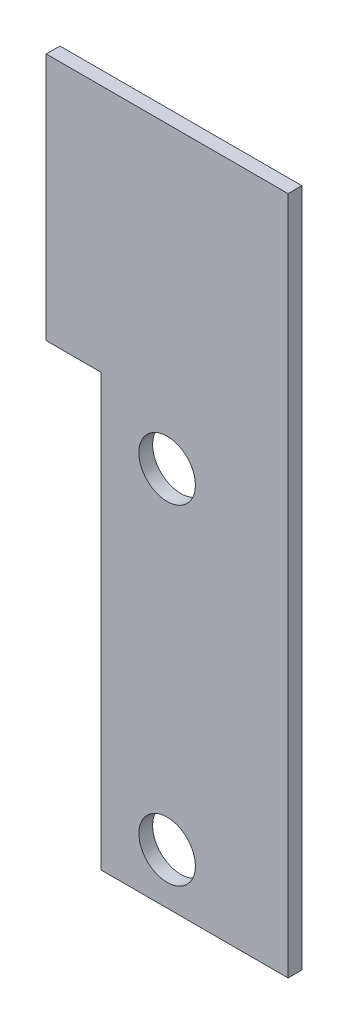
ISO-10303-21;
HEADER;
FILE_DESCRIPTION(('STEP AP214'),'2;1');
FILE_NAME('part.step','',(''),(''),'','','');
FILE_SCHEMA(('AUTOMOTIVE_DESIGN { 1 0 10303 214 1 1 1 1 }'));
ENDSEC;
DATA;
#1=APPLICATION_CONTEXT('core data for automotive mechanical design processes');
#2=APPLICATION_PROTOCOL_DEFINITION('international standard','automotive_design',2000,#1);
#3=PRODUCT_CONTEXT('',#1,'mechanical');
#4=PRODUCT('Part','Part','',(#3));
#5=PRODUCT_RELATED_PRODUCT_CATEGORY('part','',(#4));
#6=PRODUCT_DEFINITION_FORMATION('','',#4);
#7=PRODUCT_DEFINITION_CONTEXT('part definition',#1,'design');
#8=PRODUCT_DEFINITION('design','',#6,#7);
#9=PRODUCT_DEFINITION_SHAPE('','',#8);
#10=(LENGTH_UNIT() NAMED_UNIT(*) SI_UNIT(.MILLI.,.METRE.));
#11=(NAMED_UNIT(*) PLANE_ANGLE_UNIT() SI_UNIT($,.RADIAN.));
#12=(NAMED_UNIT(*) SI_UNIT($,.STERADIAN.) SOLID_ANGLE_UNIT());
#13=UNCERTAINTY_MEASURE_WITH_UNIT(LENGTH_MEASURE(1.E-05),#10,'distance_accuracy_value','');
#14=(GEOMETRIC_REPRESENTATION_CONTEXT(3) GLOBAL_UNCERTAINTY_ASSIGNED_CONTEXT((#13)) GLOBAL_UNIT_ASSIGNED_CONTEXT((#10,
#11,#12)) REPRESENTATION_CONTEXT('',''));
#15=CARTESIAN_POINT('',(0.,0.,0.));
#16=DIRECTION('',(0.,0.,1.));
#17=DIRECTION('',(1.,0.,0.));
#18=AXIS2_PLACEMENT_3D('',#15,#16,#17);
#19=CARTESIAN_POINT('',(-34.3452173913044,0.,0.79375000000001));
#20=DIRECTION('',(0.,-1.,0.));
#21=DIRECTION('',(0.,0.,-1.));
#22=AXIS2_PLACEMENT_3D('',#19,#20,#21);
#23=PLANE('',#22);
#24=DIRECTION('',(-1.,0.,0.));
#25=VECTOR('',#24,1.);
#26=CARTESIAN_POINT('',(-34.3452173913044,0.,0.79375000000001));
#27=LINE('',#26,#25);
#28=CARTESIAN_POINT('',(6.985,0.,0.793749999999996));
#29=VERTEX_POINT('',#28);
#30=CARTESIAN_POINT('',(-6.985,0.,0.793749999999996));
#31=VERTEX_POINT('',#30);
#32=EDGE_CURVE('E11',#29,#31,#27,.T.);
#33=ORIENTED_EDGE('',*,*,#32,.F.);
#34=DIRECTION('',(0.,0.,1.));
#35=VECTOR('',#34,1.);
#36=CARTESIAN_POINT('',(6.985,0.,0.));
#37=LINE('',#36,#35);
#38=CARTESIAN_POINT('',(6.985,0.,0.));
#39=VERTEX_POINT('',#38);
#40=EDGE_CURVE('E90',#39,#29,#37,.T.);
#41=ORIENTED_EDGE('',*,*,#40,.F.);
#42=DIRECTION('',(-1.,0.,0.));
#43=VECTOR('',#42,1.);
#44=CARTESIAN_POINT('',(-34.3452173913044,0.,0.));
#45=LINE('',#44,#43);
#46=CARTESIAN_POINT('',(-6.985,0.,0.));
#47=VERTEX_POINT('',#46);
#48=EDGE_CURVE('E33',#39,#47,#45,.T.);
#49=ORIENTED_EDGE('',*,*,#48,.T.);
#50=DIRECTION('',(0.,0.,1.));
#51=VECTOR('',#50,1.);
#52=CARTESIAN_POINT('',(-6.985,0.,0.));
#53=LINE('',#52,#51);
#54=EDGE_CURVE('E105',#47,#31,#53,.T.);
#55=ORIENTED_EDGE('',*,*,#54,.T.);
#56=EDGE_LOOP('',(#33,#41,#49,#55));
#57=FACE_BOUND('',#56,.T.);
#58=ADVANCED_FACE('F30',(#57),#23,.F.);
#59=CARTESIAN_POINT('',(-34.3452173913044,-75.2060869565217,0.793750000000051));
#60=DIRECTION('',(0.,0.,1.));
#61=DIRECTION('',(1.,0.,0.));
#62=AXIS2_PLACEMENT_3D('',#59,#60,#61);
#63=PLANE('',#62);
#64=DIRECTION('',(-1.,0.,0.));
#65=VECTOR('',#64,1.);
#66=CARTESIAN_POINT('',(0.,-39.2300801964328,0.793750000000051));
#67=LINE('',#66,#65);
#68=CARTESIAN_POINT('',(6.985,-39.2300801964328,0.793750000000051));
#69=VERTEX_POINT('',#68);
#70=CARTESIAN_POINT('',(-3.81,-39.2300801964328,0.793750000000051));
#71=VERTEX_POINT('',#70);
#72=EDGE_CURVE('E110',#69,#71,#67,.T.);
#73=ORIENTED_EDGE('',*,*,#72,.F.);
#74=DIRECTION('',(0.,-1.,0.));
#75=VECTOR('',#74,1.);
#76=CARTESIAN_POINT('',(6.985,-39.2300801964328,0.793750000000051));
#77=LINE('',#76,#75);
#78=EDGE_CURVE('E97',#29,#69,#77,.T.);
#79=ORIENTED_EDGE('',*,*,#78,.F.);
#80=ORIENTED_EDGE('',*,*,#32,.T.);
#81=DIRECTION('',(0.,1.,0.));
#82=VECTOR('',#81,1.);
#83=CARTESIAN_POINT('',(-6.985,-14.3380801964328,0.793749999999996));
#84=LINE('',#83,#82);
#85=CARTESIAN_POINT('',(-6.985,-14.3380801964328,0.793749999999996));
#86=VERTEX_POINT('',#85);
#87=EDGE_CURVE('E127',#86,#31,#84,.T.);
#88=ORIENTED_EDGE('',*,*,#87,.F.);
#89=DIRECTION('',(-1.,0.,0.));
#90=VECTOR('',#89,1.);
#91=CARTESIAN_POINT('',(-3.81000000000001,-14.3380801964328,0.793749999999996));
#92=LINE('',#91,#90);
#93=CARTESIAN_POINT('',(-3.81000000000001,-14.3380801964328,0.793749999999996));
#94=VERTEX_POINT('',#93);
#95=EDGE_CURVE('E125',#94,#86,#92,.T.);
#96=ORIENTED_EDGE('',*,*,#95,.F.);
#97=DIRECTION('',(0.,1.,0.));
#98=VECTOR('',#97,1.);
#99=CARTESIAN_POINT('',(-3.81,-39.2300801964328,0.793750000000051));
#100=LINE('',#99,#98);
#101=EDGE_CURVE('E123',#71,#94,#100,.T.);
#102=ORIENTED_EDGE('',*,*,#101,.F.);
#103=EDGE_LOOP('',(#73,#79,#80,#88,#96,#102));
#104=FACE_BOUND('',#103,.T.);
#105=CARTESIAN_POINT('',(0.,-17.2590801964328,0.793749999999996));
#106=DIRECTION('',(0.,0.,1.));
#107=DIRECTION('',(1.,0.,0.));
#108=AXIS2_PLACEMENT_3D('',#105,#106,#107);
#109=CIRCLE('',#108,1.63194999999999);
#110=CARTESIAN_POINT('',(1.63194999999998,-17.2590801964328,0.793749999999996));
#111=VERTEX_POINT('',#110);
#112=EDGE_CURVE('E142',#111,#111,#109,.T.);
#113=ORIENTED_EDGE('',*,*,#112,.F.);
#114=EDGE_LOOP('',(#113));
#115=FACE_BOUND('',#114,.T.);
#116=CARTESIAN_POINT('',(0.,-36.3090801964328,0.793750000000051));
#117=DIRECTION('',(0.,0.,1.));
#118=DIRECTION('',(1.,0.,0.));
#119=AXIS2_PLACEMENT_3D('',#116,#117,#118);
#120=CIRCLE('',#119,1.63194999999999);
#121=CARTESIAN_POINT('',(1.63194999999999,-36.3090801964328,0.793750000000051));
#122=VERTEX_POINT('',#121);
#123=EDGE_CURVE('E136',#122,#122,#120,.T.);
#124=ORIENTED_EDGE('',*,*,#123,.F.);
#125=EDGE_LOOP('',(#124));
#126=FACE_BOUND('',#125,.T.);
#127=ADVANCED_FACE('F147',(#104,#115,#126),#63,.T.);
#128=CARTESIAN_POINT('',(-34.3452173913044,-75.2060869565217,0.));
#129=DIRECTION('',(0.,0.,1.));
#130=DIRECTION('',(1.,0.,0.));
#131=AXIS2_PLACEMENT_3D('',#128,#129,#130);
#132=PLANE('',#131);
#133=CARTESIAN_POINT('',(0.,-17.2590801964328,0.));
#134=DIRECTION('',(0.,0.,1.));
#135=DIRECTION('',(1.,0.,0.));
#136=AXIS2_PLACEMENT_3D('',#133,#134,#135);
#137=CIRCLE('',#136,1.63195);
#138=CARTESIAN_POINT('',(1.63195,-17.2590801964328,0.));
#139=VERTEX_POINT('',#138);
#140=EDGE_CURVE('E139',#139,#139,#137,.T.);
#141=ORIENTED_EDGE('',*,*,#140,.T.);
#142=EDGE_LOOP('',(#141));
#143=FACE_BOUND('',#142,.T.);
#144=CARTESIAN_POINT('',(0.,-36.3090801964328,0.));
#145=DIRECTION('',(0.,0.,1.));
#146=DIRECTION('',(1.,0.,0.));
#147=AXIS2_PLACEMENT_3D('',#144,#145,#146);
#148=CIRCLE('',#147,1.63195);
#149=CARTESIAN_POINT('',(1.63195,-36.3090801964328,0.));
#150=VERTEX_POINT('',#149);
#151=EDGE_CURVE('E126',#150,#150,#148,.T.);
#152=ORIENTED_EDGE('',*,*,#151,.T.);
#153=EDGE_LOOP('',(#152));
#154=FACE_BOUND('',#153,.T.);
#155=DIRECTION('',(0.,-1.,0.));
#156=VECTOR('',#155,1.);
#157=CARTESIAN_POINT('',(6.985,-39.2300801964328,0.));
#158=LINE('',#157,#156);
#159=CARTESIAN_POINT('',(6.985,-39.2300801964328,0.));
#160=VERTEX_POINT('',#159);
#161=EDGE_CURVE('E86',#39,#160,#158,.T.);
#162=ORIENTED_EDGE('',*,*,#161,.T.);
#163=DIRECTION('',(-1.,0.,0.));
#164=VECTOR('',#163,1.);
#165=CARTESIAN_POINT('',(0.,-39.2300801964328,0.));
#166=LINE('',#165,#164);
#167=CARTESIAN_POINT('',(-3.81,-39.2300801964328,0.));
#168=VERTEX_POINT('',#167);
#169=EDGE_CURVE('E114',#160,#168,#166,.T.);
#170=ORIENTED_EDGE('',*,*,#169,.T.);
#171=DIRECTION('',(0.,1.,0.));
#172=VECTOR('',#171,1.);
#173=CARTESIAN_POINT('',(-3.81,-39.2300801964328,0.));
#174=LINE('',#173,#172);
#175=CARTESIAN_POINT('',(-3.81,-14.3380801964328,0.));
#176=VERTEX_POINT('',#175);
#177=EDGE_CURVE('E130',#168,#176,#174,.T.);
#178=ORIENTED_EDGE('',*,*,#177,.T.);
#179=DIRECTION('',(-1.,0.,0.));
#180=VECTOR('',#179,1.);
#181=CARTESIAN_POINT('',(-3.81,-14.3380801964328,0.));
#182=LINE('',#181,#180);
#183=CARTESIAN_POINT('',(-6.985,-14.3380801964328,0.));
#184=VERTEX_POINT('',#183);
#185=EDGE_CURVE('E119',#176,#184,#182,.T.);
#186=ORIENTED_EDGE('',*,*,#185,.T.);
#187=DIRECTION('',(0.,1.,0.));
#188=VECTOR('',#187,1.);
#189=CARTESIAN_POINT('',(-6.985,-14.3380801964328,0.));
#190=LINE('',#189,#188);
#191=EDGE_CURVE('E44',#184,#47,#190,.T.);
#192=ORIENTED_EDGE('',*,*,#191,.T.);
#193=ORIENTED_EDGE('',*,*,#48,.F.);
#194=EDGE_LOOP('',(#162,#170,#178,#186,#192,#193));
#195=FACE_BOUND('',#194,.T.);
#196=ADVANCED_FACE('F103',(#143,#154,#195),#132,.F.);
#197=CARTESIAN_POINT('',(-3.81,-39.2300801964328,0.));
#198=DIRECTION('',(1.,0.,0.));
#199=DIRECTION('',(0.,0.,-1.));
#200=AXIS2_PLACEMENT_3D('',#197,#198,#199);
#201=PLANE('',#200);
#202=ORIENTED_EDGE('',*,*,#101,.T.);
#203=DIRECTION('',(0.,0.,1.));
#204=VECTOR('',#203,1.);
#205=CARTESIAN_POINT('',(-3.81,-14.3380801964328,0.));
#206=LINE('',#205,#204);
#207=EDGE_CURVE('E71',#176,#94,#206,.T.);
#208=ORIENTED_EDGE('',*,*,#207,.F.);
#209=ORIENTED_EDGE('',*,*,#177,.F.);
#210=DIRECTION('',(0.,0.,1.));
#211=VECTOR('',#210,1.);
#212=CARTESIAN_POINT('',(-3.81,-39.2300801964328,0.));
#213=LINE('',#212,#211);
#214=EDGE_CURVE('E53',#168,#71,#213,.T.);
#215=ORIENTED_EDGE('',*,*,#214,.T.);
#216=EDGE_LOOP('',(#202,#208,#209,#215));
#217=FACE_BOUND('',#216,.T.);
#218=ADVANCED_FACE('F153',(#217),#201,.F.);
#219=CARTESIAN_POINT('',(0.,-39.2300801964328,0.));
#220=DIRECTION('',(0.,1.,0.));
#221=DIRECTION('',(0.,0.,1.));
#222=AXIS2_PLACEMENT_3D('',#219,#220,#221);
#223=PLANE('',#222);
#224=ORIENTED_EDGE('',*,*,#72,.T.);
#225=ORIENTED_EDGE('',*,*,#214,.F.);
#226=ORIENTED_EDGE('',*,*,#169,.F.);
#227=DIRECTION('',(0.,0.,1.));
#228=VECTOR('',#227,1.);
#229=CARTESIAN_POINT('',(6.985,-39.2300801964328,0.));
#230=LINE('',#229,#228);
#231=EDGE_CURVE('E93',#160,#69,#230,.T.);
#232=ORIENTED_EDGE('',*,*,#231,.T.);
#233=EDGE_LOOP('',(#224,#225,#226,#232));
#234=FACE_BOUND('',#233,.T.);
#235=ADVANCED_FACE('F150',(#234),#223,.F.);
#236=CARTESIAN_POINT('',(-6.985,-14.3380801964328,0.));
#237=DIRECTION('',(1.,0.,0.));
#238=DIRECTION('',(0.,1.,0.));
#239=AXIS2_PLACEMENT_3D('',#236,#237,#238);
#240=PLANE('',#239);
#241=ORIENTED_EDGE('',*,*,#87,.T.);
#242=ORIENTED_EDGE('',*,*,#54,.F.);
#243=ORIENTED_EDGE('',*,*,#191,.F.);
#244=DIRECTION('',(0.,0.,1.));
#245=VECTOR('',#244,1.);
#246=CARTESIAN_POINT('',(-6.985,-14.3380801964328,0.));
#247=LINE('',#246,#245);
#248=EDGE_CURVE('E107',#184,#86,#247,.T.);
#249=ORIENTED_EDGE('',*,*,#248,.T.);
#250=EDGE_LOOP('',(#241,#242,#243,#249));
#251=FACE_BOUND('',#250,.T.);
#252=ADVANCED_FACE('F152',(#251),#240,.F.);
#253=CARTESIAN_POINT('',(-3.81,-14.3380801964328,0.));
#254=DIRECTION('',(0.,1.,0.));
#255=DIRECTION('',(0.,0.,1.));
#256=AXIS2_PLACEMENT_3D('',#253,#254,#255);
#257=PLANE('',#256);
#258=ORIENTED_EDGE('',*,*,#95,.T.);
#259=ORIENTED_EDGE('',*,*,#248,.F.);
#260=ORIENTED_EDGE('',*,*,#185,.F.);
#261=ORIENTED_EDGE('',*,*,#207,.T.);
#262=EDGE_LOOP('',(#258,#259,#260,#261));
#263=FACE_BOUND('',#262,.T.);
#264=ADVANCED_FACE('F159',(#263),#257,.F.);
#265=CARTESIAN_POINT('',(0.,-36.3090801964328,0.793750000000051));
#266=DIRECTION('',(0.,0.,1.));
#267=DIRECTION('',(1.,0.,0.));
#268=AXIS2_PLACEMENT_3D('',#265,#266,#267);
#269=CYLINDRICAL_SURFACE('',#268,1.63194999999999);
#270=ORIENTED_EDGE('',*,*,#151,.F.);
#271=EDGE_LOOP('',(#270));
#272=FACE_BOUND('',#271,.T.);
#273=ORIENTED_EDGE('',*,*,#123,.T.);
#274=EDGE_LOOP('',(#273));
#275=FACE_BOUND('',#274,.T.);
#276=ADVANCED_FACE('F174',(#272,#275),#269,.F.);
#277=CARTESIAN_POINT('',(0.,-17.2590801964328,0.793749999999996));
#278=DIRECTION('',(0.,0.,1.));
#279=DIRECTION('',(1.,0.,0.));
#280=AXIS2_PLACEMENT_3D('',#277,#278,#279);
#281=CYLINDRICAL_SURFACE('',#280,1.63194999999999);
#282=ORIENTED_EDGE('',*,*,#140,.F.);
#283=EDGE_LOOP('',(#282));
#284=FACE_BOUND('',#283,.T.);
#285=ORIENTED_EDGE('',*,*,#112,.T.);
#286=EDGE_LOOP('',(#285));
#287=FACE_BOUND('',#286,.T.);
#288=ADVANCED_FACE('F178',(#284,#287),#281,.F.);
#289=CARTESIAN_POINT('',(6.985,-39.2300801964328,0.));
#290=DIRECTION('',(-1.,0.,0.));
#291=DIRECTION('',(0.,-1.,0.));
#292=AXIS2_PLACEMENT_3D('',#289,#290,#291);
#293=PLANE('',#292);
#294=ORIENTED_EDGE('',*,*,#78,.T.);
#295=ORIENTED_EDGE('',*,*,#231,.F.);
#296=ORIENTED_EDGE('',*,*,#161,.F.);
#297=ORIENTED_EDGE('',*,*,#40,.T.);
#298=EDGE_LOOP('',(#294,#295,#296,#297));
#299=FACE_BOUND('',#298,.T.);
#300=ADVANCED_FACE('F89',(#299),#293,.F.);
#301=CLOSED_SHELL('',(#58,#127,#196,#218,#235,#252,#264,#276,#288,#300));
#302=MANIFOLD_SOLID_BREP('B2',#301);
#303=ADVANCED_BREP_SHAPE_REPRESENTATION('',(#18,#302),#14);
#304=SHAPE_DEFINITION_REPRESENTATION(#9,#303);
ENDSEC;
END-ISO-10303-21;
